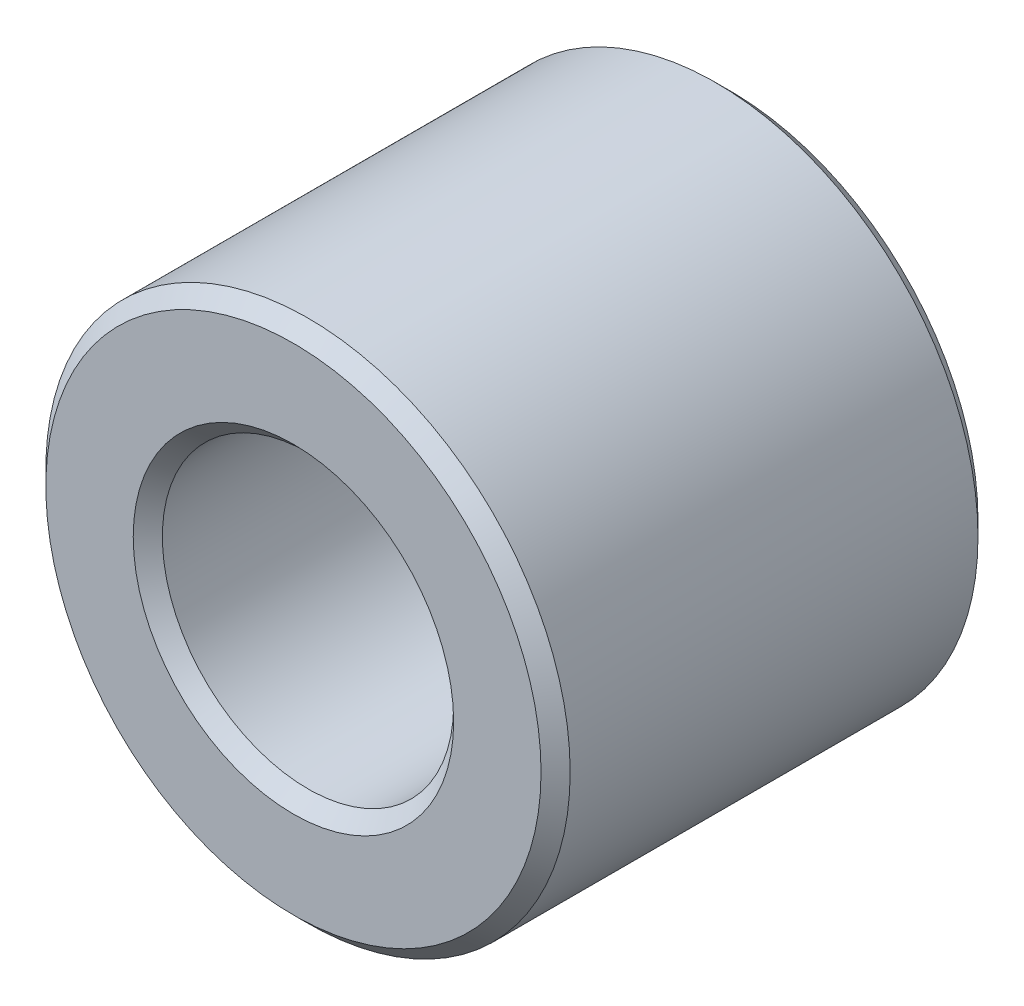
ISO-10303-21;
HEADER;
FILE_DESCRIPTION(('STEP AP214'),'2;1');
FILE_NAME('part.step','',(''),(''),'','','');
FILE_SCHEMA(('AUTOMOTIVE_DESIGN { 1 0 10303 214 1 1 1 1 }'));
ENDSEC;
DATA;
#1=APPLICATION_CONTEXT('core data for automotive mechanical design processes');
#2=APPLICATION_PROTOCOL_DEFINITION('international standard','automotive_design',2000,#1);
#3=PRODUCT_CONTEXT('',#1,'mechanical');
#4=PRODUCT('Part','Part','',(#3));
#5=PRODUCT_RELATED_PRODUCT_CATEGORY('part','',(#4));
#6=PRODUCT_DEFINITION_FORMATION('','',#4);
#7=PRODUCT_DEFINITION_CONTEXT('part definition',#1,'design');
#8=PRODUCT_DEFINITION('design','',#6,#7);
#9=PRODUCT_DEFINITION_SHAPE('','',#8);
#10=(LENGTH_UNIT() NAMED_UNIT(*) SI_UNIT(.MILLI.,.METRE.));
#11=(NAMED_UNIT(*) PLANE_ANGLE_UNIT() SI_UNIT($,.RADIAN.));
#12=(NAMED_UNIT(*) SI_UNIT($,.STERADIAN.) SOLID_ANGLE_UNIT());
#13=UNCERTAINTY_MEASURE_WITH_UNIT(LENGTH_MEASURE(1.E-05),#10,'distance_accuracy_value','');
#14=(GEOMETRIC_REPRESENTATION_CONTEXT(3) GLOBAL_UNCERTAINTY_ASSIGNED_CONTEXT((#13)) GLOBAL_UNIT_ASSIGNED_CONTEXT((#10,
#11,#12)) REPRESENTATION_CONTEXT('',''));
#15=CARTESIAN_POINT('',(0.,0.,0.));
#16=DIRECTION('',(0.,0.,1.));
#17=DIRECTION('',(1.,0.,0.));
#18=AXIS2_PLACEMENT_3D('',#15,#16,#17);
#19=CARTESIAN_POINT('',(0.,0.,37.5));
#20=DIRECTION('',(0.,0.,1.));
#21=DIRECTION('',(1.,0.,0.));
#22=AXIS2_PLACEMENT_3D('',#19,#20,#21);
#23=PLANE('',#22);
#24=CARTESIAN_POINT('',(0.,0.,37.5));
#25=DIRECTION('',(0.,0.,1.));
#26=DIRECTION('',(1.,0.,0.));
#27=AXIS2_PLACEMENT_3D('',#24,#25,#26);
#28=CIRCLE('',#27,27.5);
#29=CARTESIAN_POINT('',(27.5,0.,37.5));
#30=VERTEX_POINT('',#29);
#31=EDGE_CURVE('E10',#30,#30,#28,.F.);
#32=ORIENTED_EDGE('',*,*,#31,.T.);
#33=EDGE_LOOP('',(#32));
#34=FACE_BOUND('',#33,.T.);
#35=CARTESIAN_POINT('',(0.,0.,37.5));
#36=DIRECTION('',(0.,0.,1.));
#37=DIRECTION('',(1.,0.,0.));
#38=AXIS2_PLACEMENT_3D('',#35,#36,#37);
#39=CIRCLE('',#38,42.5);
#40=CARTESIAN_POINT('',(42.5,0.,37.5));
#41=VERTEX_POINT('',#40);
#42=EDGE_CURVE('E45',#41,#41,#39,.T.);
#43=ORIENTED_EDGE('',*,*,#42,.T.);
#44=EDGE_LOOP('',(#43));
#45=FACE_BOUND('',#44,.T.);
#46=ADVANCED_FACE('F37',(#34,#45),#23,.T.);
#47=CARTESIAN_POINT('',(0.,0.,-37.5));
#48=DIRECTION('',(0.,0.,1.));
#49=DIRECTION('',(1.,0.,0.));
#50=AXIS2_PLACEMENT_3D('',#47,#48,#49);
#51=PLANE('',#50);
#52=CARTESIAN_POINT('',(0.,0.,-37.5));
#53=DIRECTION('',(0.,0.,1.));
#54=DIRECTION('',(1.,0.,0.));
#55=AXIS2_PLACEMENT_3D('',#52,#53,#54);
#56=CIRCLE('',#55,27.5);
#57=CARTESIAN_POINT('',(27.5,0.,-37.5));
#58=VERTEX_POINT('',#57);
#59=EDGE_CURVE('E71',#58,#58,#56,.T.);
#60=ORIENTED_EDGE('',*,*,#59,.T.);
#61=EDGE_LOOP('',(#60));
#62=FACE_BOUND('',#61,.T.);
#63=CARTESIAN_POINT('',(0.,0.,-37.5));
#64=DIRECTION('',(0.,0.,1.));
#65=DIRECTION('',(1.,0.,0.));
#66=AXIS2_PLACEMENT_3D('',#63,#64,#65);
#67=CIRCLE('',#66,42.5);
#68=CARTESIAN_POINT('',(42.5,0.,-37.5));
#69=VERTEX_POINT('',#68);
#70=EDGE_CURVE('E74',#69,#69,#67,.F.);
#71=ORIENTED_EDGE('',*,*,#70,.T.);
#72=EDGE_LOOP('',(#71));
#73=FACE_BOUND('',#72,.T.);
#74=ADVANCED_FACE('F78',(#62,#73),#51,.F.);
#75=CARTESIAN_POINT('',(0.,0.,37.5));
#76=DIRECTION('',(0.,0.,-1.));
#77=DIRECTION('',(-1.,0.,0.));
#78=AXIS2_PLACEMENT_3D('',#75,#76,#77);
#79=CYLINDRICAL_SURFACE('',#78,45.);
#80=CARTESIAN_POINT('',(0.,0.,-35.));
#81=DIRECTION('',(0.,0.,1.));
#82=DIRECTION('',(1.,0.,0.));
#83=AXIS2_PLACEMENT_3D('',#80,#81,#82);
#84=CIRCLE('',#83,45.);
#85=CARTESIAN_POINT('',(45.,0.,-35.));
#86=VERTEX_POINT('',#85);
#87=EDGE_CURVE('E52',#86,#86,#84,.T.);
#88=ORIENTED_EDGE('',*,*,#87,.T.);
#89=EDGE_LOOP('',(#88));
#90=FACE_BOUND('',#89,.T.);
#91=CARTESIAN_POINT('',(0.,0.,35.));
#92=DIRECTION('',(0.,0.,1.));
#93=DIRECTION('',(1.,0.,0.));
#94=AXIS2_PLACEMENT_3D('',#91,#92,#93);
#95=CIRCLE('',#94,45.);
#96=CARTESIAN_POINT('',(45.,0.,35.));
#97=VERTEX_POINT('',#96);
#98=EDGE_CURVE('E59',#97,#97,#95,.F.);
#99=ORIENTED_EDGE('',*,*,#98,.T.);
#100=EDGE_LOOP('',(#99));
#101=FACE_BOUND('',#100,.T.);
#102=ADVANCED_FACE('F88',(#90,#101),#79,.T.);
#103=CARTESIAN_POINT('',(0.,0.,37.5));
#104=DIRECTION('',(0.,0.,-1.));
#105=DIRECTION('',(-1.,0.,0.));
#106=AXIS2_PLACEMENT_3D('',#103,#104,#105);
#107=CYLINDRICAL_SURFACE('',#106,25.);
#108=CARTESIAN_POINT('',(0.,0.,-35.));
#109=DIRECTION('',(0.,0.,1.));
#110=DIRECTION('',(1.,0.,0.));
#111=AXIS2_PLACEMENT_3D('',#108,#109,#110);
#112=CIRCLE('',#111,25.);
#113=CARTESIAN_POINT('',(25.,0.,-35.));
#114=VERTEX_POINT('',#113);
#115=EDGE_CURVE('E65',#114,#114,#112,.F.);
#116=ORIENTED_EDGE('',*,*,#115,.T.);
#117=EDGE_LOOP('',(#116));
#118=FACE_BOUND('',#117,.T.);
#119=CARTESIAN_POINT('',(0.,0.,35.));
#120=DIRECTION('',(0.,0.,1.));
#121=DIRECTION('',(1.,0.,0.));
#122=AXIS2_PLACEMENT_3D('',#119,#120,#121);
#123=CIRCLE('',#122,25.);
#124=CARTESIAN_POINT('',(25.,0.,35.));
#125=VERTEX_POINT('',#124);
#126=EDGE_CURVE('E68',#125,#125,#123,.T.);
#127=ORIENTED_EDGE('',*,*,#126,.T.);
#128=EDGE_LOOP('',(#127));
#129=FACE_BOUND('',#128,.T.);
#130=ADVANCED_FACE('F91',(#118,#129),#107,.F.);
#131=CARTESIAN_POINT('',(0.,0.,-37.5));
#132=DIRECTION('',(0.,0.,-1.));
#133=DIRECTION('',(-1.,0.,0.));
#134=AXIS2_PLACEMENT_3D('',#131,#132,#133);
#135=CONICAL_SURFACE('',#134,27.5,0.785398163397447);
#136=ORIENTED_EDGE('',*,*,#115,.F.);
#137=EDGE_LOOP('',(#136));
#138=FACE_BOUND('',#137,.T.);
#139=ORIENTED_EDGE('',*,*,#59,.F.);
#140=EDGE_LOOP('',(#139));
#141=FACE_BOUND('',#140,.T.);
#142=ADVANCED_FACE('F84',(#138,#141),#135,.F.);
#143=CARTESIAN_POINT('',(0.,0.,-35.));
#144=DIRECTION('',(0.,0.,1.));
#145=DIRECTION('',(1.,0.,0.));
#146=AXIS2_PLACEMENT_3D('',#143,#144,#145);
#147=CONICAL_SURFACE('',#146,45.,0.78539816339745);
#148=ORIENTED_EDGE('',*,*,#70,.F.);
#149=EDGE_LOOP('',(#148));
#150=FACE_BOUND('',#149,.T.);
#151=ORIENTED_EDGE('',*,*,#87,.F.);
#152=EDGE_LOOP('',(#151));
#153=FACE_BOUND('',#152,.T.);
#154=ADVANCED_FACE('F80',(#150,#153),#147,.T.);
#155=CARTESIAN_POINT('',(0.,0.,35.));
#156=DIRECTION('',(0.,0.,1.));
#157=DIRECTION('',(1.,0.,0.));
#158=AXIS2_PLACEMENT_3D('',#155,#156,#157);
#159=CONICAL_SURFACE('',#158,25.,0.785398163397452);
#160=ORIENTED_EDGE('',*,*,#31,.F.);
#161=EDGE_LOOP('',(#160));
#162=FACE_BOUND('',#161,.T.);
#163=ORIENTED_EDGE('',*,*,#126,.F.);
#164=EDGE_LOOP('',(#163));
#165=FACE_BOUND('',#164,.T.);
#166=ADVANCED_FACE('F83',(#162,#165),#159,.F.);
#167=CARTESIAN_POINT('',(0.,0.,37.5));
#168=DIRECTION('',(0.,0.,-1.));
#169=DIRECTION('',(-1.,0.,0.));
#170=AXIS2_PLACEMENT_3D('',#167,#168,#169);
#171=CONICAL_SURFACE('',#170,42.5,0.78539816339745);
#172=ORIENTED_EDGE('',*,*,#98,.F.);
#173=EDGE_LOOP('',(#172));
#174=FACE_BOUND('',#173,.T.);
#175=ORIENTED_EDGE('',*,*,#42,.F.);
#176=EDGE_LOOP('',(#175));
#177=FACE_BOUND('',#176,.T.);
#178=ADVANCED_FACE('F39',(#174,#177),#171,.T.);
#179=CLOSED_SHELL('',(#46,#74,#102,#130,#142,#154,#166,#178));
#180=MANIFOLD_SOLID_BREP('B2',#179);
#181=ADVANCED_BREP_SHAPE_REPRESENTATION('',(#18,#180),#14);
#182=SHAPE_DEFINITION_REPRESENTATION(#9,#181);
ENDSEC;
END-ISO-10303-21;
